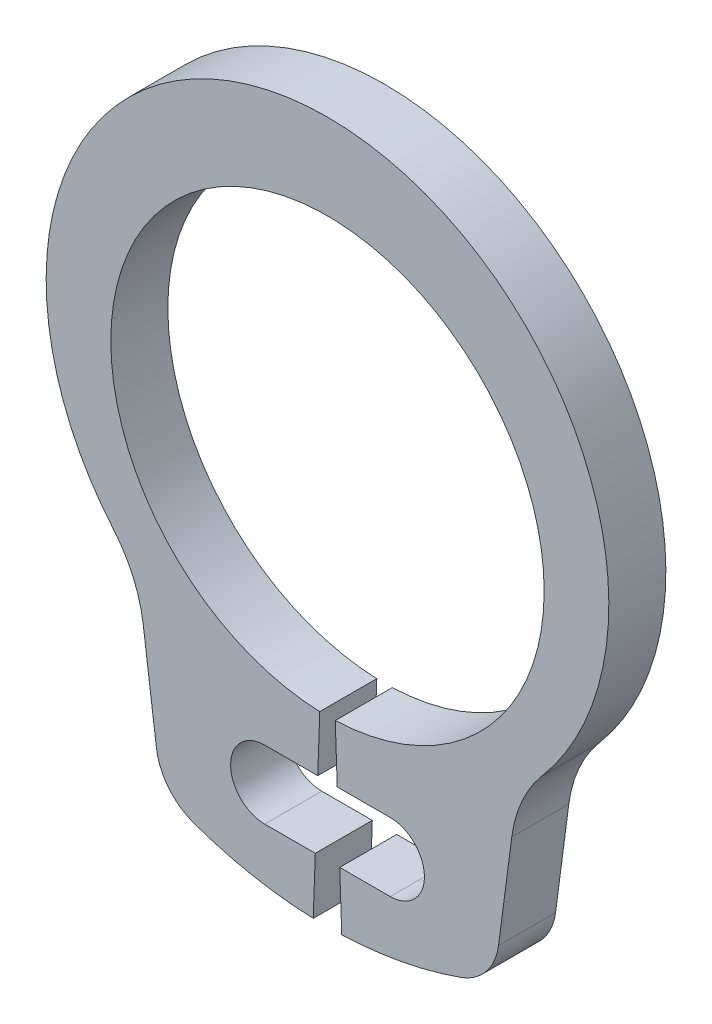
ISO-10303-21;
HEADER;
FILE_DESCRIPTION(('STEP AP214'),'2;1');
FILE_NAME('part.step','',(''),(''),'','','');
FILE_SCHEMA(('AUTOMOTIVE_DESIGN { 1 0 10303 214 1 1 1 1 }'));
ENDSEC;
DATA;
#1=APPLICATION_CONTEXT('core data for automotive mechanical design processes');
#2=APPLICATION_PROTOCOL_DEFINITION('international standard','automotive_design',2000,#1);
#3=PRODUCT_CONTEXT('',#1,'mechanical');
#4=PRODUCT('Part','Part','',(#3));
#5=PRODUCT_RELATED_PRODUCT_CATEGORY('part','',(#4));
#6=PRODUCT_DEFINITION_FORMATION('','',#4);
#7=PRODUCT_DEFINITION_CONTEXT('part definition',#1,'design');
#8=PRODUCT_DEFINITION('design','',#6,#7);
#9=PRODUCT_DEFINITION_SHAPE('','',#8);
#10=(LENGTH_UNIT() NAMED_UNIT(*) SI_UNIT(.MILLI.,.METRE.));
#11=(NAMED_UNIT(*) PLANE_ANGLE_UNIT() SI_UNIT($,.RADIAN.));
#12=(NAMED_UNIT(*) SI_UNIT($,.STERADIAN.) SOLID_ANGLE_UNIT());
#13=UNCERTAINTY_MEASURE_WITH_UNIT(LENGTH_MEASURE(1.E-05),#10,'distance_accuracy_value','');
#14=(GEOMETRIC_REPRESENTATION_CONTEXT(3) GLOBAL_UNCERTAINTY_ASSIGNED_CONTEXT((#13)) GLOBAL_UNIT_ASSIGNED_CONTEXT((#10,
#11,#12)) REPRESENTATION_CONTEXT('',''));
#15=CARTESIAN_POINT('',(0.,0.,0.));
#16=DIRECTION('',(0.,0.,1.));
#17=DIRECTION('',(1.,0.,0.));
#18=AXIS2_PLACEMENT_3D('',#15,#16,#17);
#19=CARTESIAN_POINT('',(-0.135714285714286,-3.79757575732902,-1.));
#20=DIRECTION('',(0.999362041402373,-0.0357142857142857,0.));
#21=DIRECTION('',(0.0357142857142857,0.999362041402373,0.));
#22=AXIS2_PLACEMENT_3D('',#19,#20,#21);
#23=PLANE('',#22);
#24=DIRECTION('',(0.,0.,1.));
#25=VECTOR('',#24,1.);
#26=CARTESIAN_POINT('',(-0.171140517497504,-4.78887743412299,-1.));
#27=LINE('',#26,#25);
#28=CARTESIAN_POINT('',(-0.171140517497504,-4.78887743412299,-1.));
#29=VERTEX_POINT('',#28);
#30=CARTESIAN_POINT('',(-0.171140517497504,-4.78887743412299,0.));
#31=VERTEX_POINT('',#30);
#32=EDGE_CURVE('E201',#29,#31,#27,.T.);
#33=ORIENTED_EDGE('',*,*,#32,.F.);
#34=DIRECTION('',(0.0357142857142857,0.999362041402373,0.));
#35=VECTOR('',#34,1.);
#36=CARTESIAN_POINT('',(-0.135714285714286,-3.79757575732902,-1.));
#37=LINE('',#36,#35);
#38=CARTESIAN_POINT('',(-0.135714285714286,-3.79757575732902,-1.));
#39=VERTEX_POINT('',#38);
#40=EDGE_CURVE('E283',#29,#39,#37,.T.);
#41=ORIENTED_EDGE('',*,*,#40,.T.);
#42=DIRECTION('',(0.,0.,1.));
#43=VECTOR('',#42,1.);
#44=CARTESIAN_POINT('',(-0.135714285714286,-3.79757575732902,-1.));
#45=LINE('',#44,#43);
#46=CARTESIAN_POINT('',(-0.135714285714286,-3.79757575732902,0.));
#47=VERTEX_POINT('',#46);
#48=EDGE_CURVE('E11',#39,#47,#45,.T.);
#49=ORIENTED_EDGE('',*,*,#48,.T.);
#50=DIRECTION('',(0.0357142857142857,0.999362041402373,0.));
#51=VECTOR('',#50,1.);
#52=CARTESIAN_POINT('',(-0.135714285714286,-3.79757575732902,0.));
#53=LINE('',#52,#51);
#54=EDGE_CURVE('E247',#31,#47,#53,.T.);
#55=ORIENTED_EDGE('',*,*,#54,.F.);
#56=EDGE_LOOP('',(#33,#41,#49,#55));
#57=FACE_BOUND('',#56,.T.);
#58=ADVANCED_FACE('F34',(#57),#23,.T.);
#59=CARTESIAN_POINT('',(0.135714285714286,-3.79757575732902,-1.));
#60=DIRECTION('',(-0.999362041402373,-0.0357142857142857,0.));
#61=DIRECTION('',(0.0357142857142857,-0.999362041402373,0.));
#62=AXIS2_PLACEMENT_3D('',#59,#60,#61);
#63=PLANE('',#62);
#64=DIRECTION('',(0.,0.,-1.));
#65=VECTOR('',#64,1.);
#66=CARTESIAN_POINT('',(0.171140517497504,-4.78887743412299,-1.));
#67=LINE('',#66,#65);
#68=CARTESIAN_POINT('',(0.171140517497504,-4.78887743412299,0.));
#69=VERTEX_POINT('',#68);
#70=CARTESIAN_POINT('',(0.171140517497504,-4.78887743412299,-1.));
#71=VERTEX_POINT('',#70);
#72=EDGE_CURVE('E205',#69,#71,#67,.T.);
#73=ORIENTED_EDGE('',*,*,#72,.F.);
#74=DIRECTION('',(0.0357142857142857,-0.999362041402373,0.));
#75=VECTOR('',#74,1.);
#76=CARTESIAN_POINT('',(0.135714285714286,-3.79757575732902,0.));
#77=LINE('',#76,#75);
#78=CARTESIAN_POINT('',(0.135714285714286,-3.79757575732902,0.));
#79=VERTEX_POINT('',#78);
#80=EDGE_CURVE('E218',#79,#69,#77,.T.);
#81=ORIENTED_EDGE('',*,*,#80,.F.);
#82=DIRECTION('',(0.,0.,1.));
#83=VECTOR('',#82,1.);
#84=CARTESIAN_POINT('',(0.135714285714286,-3.79757575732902,-1.));
#85=LINE('',#84,#83);
#86=CARTESIAN_POINT('',(0.135714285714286,-3.79757575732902,-1.));
#87=VERTEX_POINT('',#86);
#88=EDGE_CURVE('E38',#87,#79,#85,.T.);
#89=ORIENTED_EDGE('',*,*,#88,.F.);
#90=DIRECTION('',(0.0357142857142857,-0.999362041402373,0.));
#91=VECTOR('',#90,1.);
#92=CARTESIAN_POINT('',(0.135714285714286,-3.79757575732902,-1.));
#93=LINE('',#92,#91);
#94=EDGE_CURVE('E253',#87,#71,#93,.T.);
#95=ORIENTED_EDGE('',*,*,#94,.T.);
#96=EDGE_LOOP('',(#73,#81,#89,#95));
#97=FACE_BOUND('',#96,.T.);
#98=ADVANCED_FACE('F317',(#97),#63,.T.);
#99=CARTESIAN_POINT('',(0.,0.,-1.));
#100=DIRECTION('',(0.,0.,1.));
#101=DIRECTION('',(1.,0.,0.));
#102=AXIS2_PLACEMENT_3D('',#99,#100,#101);
#103=CYLINDRICAL_SURFACE('',#102,3.8);
#104=CARTESIAN_POINT('',(0.,0.,0.));
#105=DIRECTION('',(0.,0.,-1.));
#106=DIRECTION('',(1.,0.,0.));
#107=AXIS2_PLACEMENT_3D('',#104,#105,#106);
#108=CIRCLE('',#107,3.8);
#109=EDGE_CURVE('E214',#47,#79,#108,.T.);
#110=ORIENTED_EDGE('',*,*,#109,.F.);
#111=ORIENTED_EDGE('',*,*,#48,.F.);
#112=CARTESIAN_POINT('',(0.,0.,-1.));
#113=DIRECTION('',(0.,0.,-1.));
#114=DIRECTION('',(1.,0.,0.));
#115=AXIS2_PLACEMENT_3D('',#112,#113,#114);
#116=CIRCLE('',#115,3.8);
#117=EDGE_CURVE('E249',#39,#87,#116,.T.);
#118=ORIENTED_EDGE('',*,*,#117,.T.);
#119=ORIENTED_EDGE('',*,*,#88,.T.);
#120=EDGE_LOOP('',(#110,#111,#118,#119));
#121=FACE_BOUND('',#120,.T.);
#122=ADVANCED_FACE('F36',(#121),#103,.F.);
#123=DIRECTION('',(0.,0.,-1.));
#124=VECTOR('',#123,1.);
#125=CARTESIAN_POINT('',(-0.214025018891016,-5.98887743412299,-1.));
#126=LINE('',#125,#124);
#127=CARTESIAN_POINT('',(-0.214025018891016,-5.98887743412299,0.));
#128=VERTEX_POINT('',#127);
#129=CARTESIAN_POINT('',(-0.214025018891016,-5.98887743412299,-1.));
#130=VERTEX_POINT('',#129);
#131=EDGE_CURVE('E339',#128,#130,#126,.T.);
#132=ORIENTED_EDGE('',*,*,#131,.F.);
#133=CARTESIAN_POINT('',(-0.25,-6.99553428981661,0.));
#134=VERTEX_POINT('',#133);
#135=EDGE_CURVE('E195',#134,#128,#53,.T.);
#136=ORIENTED_EDGE('',*,*,#135,.F.);
#137=DIRECTION('',(0.,0.,1.));
#138=VECTOR('',#137,1.);
#139=CARTESIAN_POINT('',(-0.25,-6.99553428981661,-1.));
#140=LINE('',#139,#138);
#141=CARTESIAN_POINT('',(-0.25,-6.99553428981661,-1.));
#142=VERTEX_POINT('',#141);
#143=EDGE_CURVE('E43',#142,#134,#140,.T.);
#144=ORIENTED_EDGE('',*,*,#143,.F.);
#145=EDGE_CURVE('E284',#142,#130,#37,.T.);
#146=ORIENTED_EDGE('',*,*,#145,.T.);
#147=EDGE_LOOP('',(#132,#136,#144,#146));
#148=FACE_BOUND('',#147,.T.);
#149=ADVANCED_FACE('F348',(#148),#23,.T.);
#150=CARTESIAN_POINT('',(0.,0.,-1.));
#151=DIRECTION('',(0.,0.,1.));
#152=DIRECTION('',(1.,0.,0.));
#153=AXIS2_PLACEMENT_3D('',#150,#151,#152);
#154=CYLINDRICAL_SURFACE('',#153,7.);
#155=CARTESIAN_POINT('',(0.,0.,0.));
#156=DIRECTION('',(0.,0.,1.));
#157=DIRECTION('',(1.,0.,0.));
#158=AXIS2_PLACEMENT_3D('',#155,#156,#157);
#159=CIRCLE('',#158,7.);
#160=CARTESIAN_POINT('',(-2.34274629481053,-6.59632775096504,0.));
#161=VERTEX_POINT('',#160);
#162=EDGE_CURVE('E245',#161,#134,#159,.T.);
#163=ORIENTED_EDGE('',*,*,#162,.F.);
#164=DIRECTION('',(0.,0.,1.));
#165=VECTOR('',#164,1.);
#166=CARTESIAN_POINT('',(-2.34274629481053,-6.59632775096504,-1.));
#167=LINE('',#166,#165);
#168=CARTESIAN_POINT('',(-2.34274629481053,-6.59632775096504,-1.));
#169=VERTEX_POINT('',#168);
#170=EDGE_CURVE('E288',#169,#161,#167,.T.);
#171=ORIENTED_EDGE('',*,*,#170,.F.);
#172=CARTESIAN_POINT('',(0.,0.,-1.));
#173=DIRECTION('',(0.,0.,1.));
#174=DIRECTION('',(1.,0.,0.));
#175=AXIS2_PLACEMENT_3D('',#172,#173,#174);
#176=CIRCLE('',#175,7.);
#177=EDGE_CURVE('E280',#169,#142,#176,.T.);
#178=ORIENTED_EDGE('',*,*,#177,.T.);
#179=ORIENTED_EDGE('',*,*,#143,.T.);
#180=EDGE_LOOP('',(#163,#171,#178,#179));
#181=FACE_BOUND('',#180,.T.);
#182=ADVANCED_FACE('F351',(#181),#154,.T.);
#183=CARTESIAN_POINT('',(-2.00806825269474,-5.65399521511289,-1.));
#184=DIRECTION('',(0.,0.,1.));
#185=DIRECTION('',(1.,0.,0.));
#186=AXIS2_PLACEMENT_3D('',#183,#184,#185);
#187=CYLINDRICAL_SURFACE('',#186,1.);
#188=CARTESIAN_POINT('',(-2.00806825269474,-5.65399521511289,0.));
#189=DIRECTION('',(0.,0.,1.));
#190=DIRECTION('',(1.,0.,0.));
#191=AXIS2_PLACEMENT_3D('',#188,#189,#190);
#192=CIRCLE('',#191,1.);
#193=CARTESIAN_POINT('',(-2.99951311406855,-5.78452140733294,0.));
#194=VERTEX_POINT('',#193);
#195=EDGE_CURVE('E242',#194,#161,#192,.T.);
#196=ORIENTED_EDGE('',*,*,#195,.F.);
#197=DIRECTION('',(0.,0.,1.));
#198=VECTOR('',#197,1.);
#199=CARTESIAN_POINT('',(-2.99951311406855,-5.78452140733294,-1.));
#200=LINE('',#199,#198);
#201=CARTESIAN_POINT('',(-2.99951311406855,-5.78452140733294,-1.));
#202=VERTEX_POINT('',#201);
#203=EDGE_CURVE('E290',#202,#194,#200,.T.);
#204=ORIENTED_EDGE('',*,*,#203,.F.);
#205=CARTESIAN_POINT('',(-2.00806825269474,-5.65399521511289,-1.));
#206=DIRECTION('',(0.,0.,1.));
#207=DIRECTION('',(1.,0.,0.));
#208=AXIS2_PLACEMENT_3D('',#205,#206,#207);
#209=CIRCLE('',#208,1.);
#210=EDGE_CURVE('E277',#202,#169,#209,.T.);
#211=ORIENTED_EDGE('',*,*,#210,.T.);
#212=ORIENTED_EDGE('',*,*,#170,.T.);
#213=EDGE_LOOP('',(#196,#204,#211,#212));
#214=FACE_BOUND('',#213,.T.);
#215=ADVANCED_FACE('F356',(#214),#187,.T.);
#216=CARTESIAN_POINT('',(-3.232103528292,-4.01782181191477,-1.));
#217=DIRECTION('',(-0.99144486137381,-0.130526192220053,0.));
#218=DIRECTION('',(0.130526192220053,-0.99144486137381,0.));
#219=AXIS2_PLACEMENT_3D('',#216,#217,#218);
#220=PLANE('',#219);
#221=DIRECTION('',(0.130526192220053,-0.99144486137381,0.));
#222=VECTOR('',#221,1.);
#223=CARTESIAN_POINT('',(-3.232103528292,-4.01782181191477,0.));
#224=LINE('',#223,#222);
#225=CARTESIAN_POINT('',(-3.232103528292,-4.01782181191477,0.));
#226=VERTEX_POINT('',#225);
#227=EDGE_CURVE('E239',#226,#194,#224,.T.);
#228=ORIENTED_EDGE('',*,*,#227,.F.);
#229=DIRECTION('',(0.,0.,1.));
#230=VECTOR('',#229,1.);
#231=CARTESIAN_POINT('',(-3.232103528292,-4.01782181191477,-1.));
#232=LINE('',#231,#230);
#233=CARTESIAN_POINT('',(-3.232103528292,-4.01782181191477,-1.));
#234=VERTEX_POINT('',#233);
#235=EDGE_CURVE('E292',#234,#226,#232,.T.);
#236=ORIENTED_EDGE('',*,*,#235,.F.);
#237=DIRECTION('',(0.130526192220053,-0.99144486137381,0.));
#238=VECTOR('',#237,1.);
#239=CARTESIAN_POINT('',(-3.232103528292,-4.01782181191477,-1.));
#240=LINE('',#239,#238);
#241=EDGE_CURVE('E274',#234,#202,#240,.T.);
#242=ORIENTED_EDGE('',*,*,#241,.T.);
#243=ORIENTED_EDGE('',*,*,#203,.T.);
#244=EDGE_LOOP('',(#228,#236,#242,#243));
#245=FACE_BOUND('',#244,.T.);
#246=ADVANCED_FACE('F359',(#245),#220,.T.);
#247=CARTESIAN_POINT('',(-5.50977445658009,-4.3176828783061,-1.));
#248=DIRECTION('',(0.,0.,1.));
#249=DIRECTION('',(1.,0.,0.));
#250=AXIS2_PLACEMENT_3D('',#247,#248,#249);
#251=CYLINDRICAL_SURFACE('',#250,2.29732486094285);
#252=CARTESIAN_POINT('',(-5.50977445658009,-4.3176828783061,0.));
#253=DIRECTION('',(0.,0.,-1.));
#254=DIRECTION('',(1.,0.,0.));
#255=AXIS2_PLACEMENT_3D('',#252,#253,#254);
#256=CIRCLE('',#255,2.29732486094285);
#257=CARTESIAN_POINT('',(-3.75939498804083,-2.82977386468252,0.));
#258=VERTEX_POINT('',#257);
#259=EDGE_CURVE('E236',#258,#226,#256,.T.);
#260=ORIENTED_EDGE('',*,*,#259,.F.);
#261=DIRECTION('',(0.,0.,1.));
#262=VECTOR('',#261,1.);
#263=CARTESIAN_POINT('',(-3.75939498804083,-2.82977386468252,-1.));
#264=LINE('',#263,#262);
#265=CARTESIAN_POINT('',(-3.75939498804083,-2.82977386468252,-1.));
#266=VERTEX_POINT('',#265);
#267=EDGE_CURVE('E294',#266,#258,#264,.T.);
#268=ORIENTED_EDGE('',*,*,#267,.F.);
#269=CARTESIAN_POINT('',(-5.50977445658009,-4.3176828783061,-1.));
#270=DIRECTION('',(0.,0.,-1.));
#271=DIRECTION('',(1.,0.,0.));
#272=AXIS2_PLACEMENT_3D('',#269,#270,#271);
#273=CIRCLE('',#272,2.29732486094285);
#274=EDGE_CURVE('E271',#266,#234,#273,.T.);
#275=ORIENTED_EDGE('',*,*,#274,.T.);
#276=ORIENTED_EDGE('',*,*,#235,.T.);
#277=EDGE_LOOP('',(#260,#268,#275,#276));
#278=FACE_BOUND('',#277,.T.);
#279=ADVANCED_FACE('F364',(#278),#251,.F.);
#280=CARTESIAN_POINT('',(0.,0.365897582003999,-1.));
#281=DIRECTION('',(0.,0.,1.));
#282=DIRECTION('',(1.,0.,0.));
#283=AXIS2_PLACEMENT_3D('',#280,#281,#282);
#284=CYLINDRICAL_SURFACE('',#283,4.934102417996);
#285=CARTESIAN_POINT('',(0.,0.365897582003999,0.));
#286=DIRECTION('',(0.,0.,1.));
#287=DIRECTION('',(1.,0.,0.));
#288=AXIS2_PLACEMENT_3D('',#285,#286,#287);
#289=CIRCLE('',#288,4.934102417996);
#290=CARTESIAN_POINT('',(3.75939498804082,-2.82977386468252,0.));
#291=VERTEX_POINT('',#290);
#292=EDGE_CURVE('E233',#291,#258,#289,.T.);
#293=ORIENTED_EDGE('',*,*,#292,.F.);
#294=DIRECTION('',(0.,0.,1.));
#295=VECTOR('',#294,1.);
#296=CARTESIAN_POINT('',(3.75939498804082,-2.82977386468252,-1.));
#297=LINE('',#296,#295);
#298=CARTESIAN_POINT('',(3.75939498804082,-2.82977386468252,-1.));
#299=VERTEX_POINT('',#298);
#300=EDGE_CURVE('E296',#299,#291,#297,.T.);
#301=ORIENTED_EDGE('',*,*,#300,.F.);
#302=CARTESIAN_POINT('',(0.,0.365897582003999,-1.));
#303=DIRECTION('',(0.,0.,1.));
#304=DIRECTION('',(1.,0.,0.));
#305=AXIS2_PLACEMENT_3D('',#302,#303,#304);
#306=CIRCLE('',#305,4.934102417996);
#307=EDGE_CURVE('E268',#299,#266,#306,.T.);
#308=ORIENTED_EDGE('',*,*,#307,.T.);
#309=ORIENTED_EDGE('',*,*,#267,.T.);
#310=EDGE_LOOP('',(#293,#301,#308,#309));
#311=FACE_BOUND('',#310,.T.);
#312=ADVANCED_FACE('F367',(#311),#284,.T.);
#313=CARTESIAN_POINT('',(5.50977445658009,-4.3176828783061,-1.));
#314=DIRECTION('',(0.,0.,1.));
#315=DIRECTION('',(1.,0.,0.));
#316=AXIS2_PLACEMENT_3D('',#313,#314,#315);
#317=CYLINDRICAL_SURFACE('',#316,2.29732486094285);
#318=CARTESIAN_POINT('',(5.50977445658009,-4.3176828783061,0.));
#319=DIRECTION('',(0.,0.,-1.));
#320=DIRECTION('',(1.,0.,0.));
#321=AXIS2_PLACEMENT_3D('',#318,#319,#320);
#322=CIRCLE('',#321,2.29732486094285);
#323=CARTESIAN_POINT('',(3.232103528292,-4.01782181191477,0.));
#324=VERTEX_POINT('',#323);
#325=EDGE_CURVE('E230',#324,#291,#322,.T.);
#326=ORIENTED_EDGE('',*,*,#325,.F.);
#327=DIRECTION('',(0.,0.,1.));
#328=VECTOR('',#327,1.);
#329=CARTESIAN_POINT('',(3.232103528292,-4.01782181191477,-1.));
#330=LINE('',#329,#328);
#331=CARTESIAN_POINT('',(3.232103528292,-4.01782181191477,-1.));
#332=VERTEX_POINT('',#331);
#333=EDGE_CURVE('E298',#332,#324,#330,.T.);
#334=ORIENTED_EDGE('',*,*,#333,.F.);
#335=CARTESIAN_POINT('',(5.50977445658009,-4.3176828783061,-1.));
#336=DIRECTION('',(0.,0.,-1.));
#337=DIRECTION('',(1.,0.,0.));
#338=AXIS2_PLACEMENT_3D('',#335,#336,#337);
#339=CIRCLE('',#338,2.29732486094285);
#340=EDGE_CURVE('E265',#332,#299,#339,.T.);
#341=ORIENTED_EDGE('',*,*,#340,.T.);
#342=ORIENTED_EDGE('',*,*,#300,.T.);
#343=EDGE_LOOP('',(#326,#334,#341,#342));
#344=FACE_BOUND('',#343,.T.);
#345=ADVANCED_FACE('F372',(#344),#317,.F.);
#346=CARTESIAN_POINT('',(3.232103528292,-4.01782181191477,-1.));
#347=DIRECTION('',(0.99144486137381,-0.130526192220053,0.));
#348=DIRECTION('',(0.130526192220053,0.99144486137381,0.));
#349=AXIS2_PLACEMENT_3D('',#346,#347,#348);
#350=PLANE('',#349);
#351=DIRECTION('',(0.130526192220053,0.99144486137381,0.));
#352=VECTOR('',#351,1.);
#353=CARTESIAN_POINT('',(3.232103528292,-4.01782181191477,0.));
#354=LINE('',#353,#352);
#355=CARTESIAN_POINT('',(2.99951311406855,-5.78452140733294,0.));
#356=VERTEX_POINT('',#355);
#357=EDGE_CURVE('E227',#356,#324,#354,.T.);
#358=ORIENTED_EDGE('',*,*,#357,.F.);
#359=DIRECTION('',(0.,0.,1.));
#360=VECTOR('',#359,1.);
#361=CARTESIAN_POINT('',(2.99951311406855,-5.78452140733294,-1.));
#362=LINE('',#361,#360);
#363=CARTESIAN_POINT('',(2.99951311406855,-5.78452140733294,-1.));
#364=VERTEX_POINT('',#363);
#365=EDGE_CURVE('E300',#364,#356,#362,.T.);
#366=ORIENTED_EDGE('',*,*,#365,.F.);
#367=DIRECTION('',(0.130526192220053,0.99144486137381,0.));
#368=VECTOR('',#367,1.);
#369=CARTESIAN_POINT('',(3.232103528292,-4.01782181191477,-1.));
#370=LINE('',#369,#368);
#371=EDGE_CURVE('E262',#364,#332,#370,.T.);
#372=ORIENTED_EDGE('',*,*,#371,.T.);
#373=ORIENTED_EDGE('',*,*,#333,.T.);
#374=EDGE_LOOP('',(#358,#366,#372,#373));
#375=FACE_BOUND('',#374,.T.);
#376=ADVANCED_FACE('F375',(#375),#350,.T.);
#377=CARTESIAN_POINT('',(2.00806825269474,-5.65399521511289,-1.));
#378=DIRECTION('',(0.,0.,1.));
#379=DIRECTION('',(1.,0.,0.));
#380=AXIS2_PLACEMENT_3D('',#377,#378,#379);
#381=CYLINDRICAL_SURFACE('',#380,1.);
#382=CARTESIAN_POINT('',(2.00806825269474,-5.65399521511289,0.));
#383=DIRECTION('',(0.,0.,1.));
#384=DIRECTION('',(-1.,0.,0.));
#385=AXIS2_PLACEMENT_3D('',#382,#383,#384);
#386=CIRCLE('',#385,1.);
#387=CARTESIAN_POINT('',(2.34274629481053,-6.59632775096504,0.));
#388=VERTEX_POINT('',#387);
#389=EDGE_CURVE('E224',#388,#356,#386,.T.);
#390=ORIENTED_EDGE('',*,*,#389,.F.);
#391=DIRECTION('',(0.,0.,1.));
#392=VECTOR('',#391,1.);
#393=CARTESIAN_POINT('',(2.34274629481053,-6.59632775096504,-1.));
#394=LINE('',#393,#392);
#395=CARTESIAN_POINT('',(2.34274629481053,-6.59632775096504,-1.));
#396=VERTEX_POINT('',#395);
#397=EDGE_CURVE('E302',#396,#388,#394,.T.);
#398=ORIENTED_EDGE('',*,*,#397,.F.);
#399=CARTESIAN_POINT('',(2.00806825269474,-5.65399521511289,-1.));
#400=DIRECTION('',(0.,0.,1.));
#401=DIRECTION('',(-1.,0.,0.));
#402=AXIS2_PLACEMENT_3D('',#399,#400,#401);
#403=CIRCLE('',#402,1.);
#404=EDGE_CURVE('E259',#396,#364,#403,.T.);
#405=ORIENTED_EDGE('',*,*,#404,.T.);
#406=ORIENTED_EDGE('',*,*,#365,.T.);
#407=EDGE_LOOP('',(#390,#398,#405,#406));
#408=FACE_BOUND('',#407,.T.);
#409=ADVANCED_FACE('F380',(#408),#381,.T.);
#410=CARTESIAN_POINT('',(0.,0.,-1.));
#411=DIRECTION('',(0.,0.,1.));
#412=DIRECTION('',(1.,0.,0.));
#413=AXIS2_PLACEMENT_3D('',#410,#411,#412);
#414=CYLINDRICAL_SURFACE('',#413,7.);
#415=CARTESIAN_POINT('',(0.,0.,0.));
#416=DIRECTION('',(0.,0.,1.));
#417=DIRECTION('',(1.,0.,0.));
#418=AXIS2_PLACEMENT_3D('',#415,#416,#417);
#419=CIRCLE('',#418,7.);
#420=CARTESIAN_POINT('',(0.249999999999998,-6.99553428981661,0.));
#421=VERTEX_POINT('',#420);
#422=EDGE_CURVE('E221',#421,#388,#419,.T.);
#423=ORIENTED_EDGE('',*,*,#422,.F.);
#424=DIRECTION('',(0.,0.,1.));
#425=VECTOR('',#424,1.);
#426=CARTESIAN_POINT('',(0.249999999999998,-6.99553428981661,-1.));
#427=LINE('',#426,#425);
#428=CARTESIAN_POINT('',(0.249999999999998,-6.99553428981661,-1.));
#429=VERTEX_POINT('',#428);
#430=EDGE_CURVE('E303',#429,#421,#427,.T.);
#431=ORIENTED_EDGE('',*,*,#430,.F.);
#432=CARTESIAN_POINT('',(0.,0.,-1.));
#433=DIRECTION('',(0.,0.,1.));
#434=DIRECTION('',(1.,0.,0.));
#435=AXIS2_PLACEMENT_3D('',#432,#433,#434);
#436=CIRCLE('',#435,7.);
#437=EDGE_CURVE('E256',#429,#396,#436,.T.);
#438=ORIENTED_EDGE('',*,*,#437,.T.);
#439=ORIENTED_EDGE('',*,*,#397,.T.);
#440=EDGE_LOOP('',(#423,#431,#438,#439));
#441=FACE_BOUND('',#440,.T.);
#442=ADVANCED_FACE('F382',(#441),#414,.T.);
#443=DIRECTION('',(0.,0.,1.));
#444=VECTOR('',#443,1.);
#445=CARTESIAN_POINT('',(0.214025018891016,-5.98887743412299,-1.));
#446=LINE('',#445,#444);
#447=CARTESIAN_POINT('',(0.214025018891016,-5.98887743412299,-1.));
#448=VERTEX_POINT('',#447);
#449=CARTESIAN_POINT('',(0.214025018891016,-5.98887743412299,0.));
#450=VERTEX_POINT('',#449);
#451=EDGE_CURVE('E335',#448,#450,#446,.T.);
#452=ORIENTED_EDGE('',*,*,#451,.F.);
#453=EDGE_CURVE('E252',#448,#429,#93,.T.);
#454=ORIENTED_EDGE('',*,*,#453,.T.);
#455=ORIENTED_EDGE('',*,*,#430,.T.);
#456=EDGE_CURVE('E217',#450,#421,#77,.T.);
#457=ORIENTED_EDGE('',*,*,#456,.F.);
#458=EDGE_LOOP('',(#452,#454,#455,#457));
#459=FACE_BOUND('',#458,.T.);
#460=ADVANCED_FACE('F385',(#459),#63,.T.);
#461=CARTESIAN_POINT('',(0.,0.,-1.));
#462=DIRECTION('',(0.,0.,1.));
#463=DIRECTION('',(1.,0.,0.));
#464=AXIS2_PLACEMENT_3D('',#461,#462,#463);
#465=PLANE('',#464);
#466=CARTESIAN_POINT('',(1.1,-5.38887743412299,-1.));
#467=DIRECTION('',(0.,0.,1.));
#468=DIRECTION('',(1.,0.,0.));
#469=AXIS2_PLACEMENT_3D('',#466,#467,#468);
#470=CIRCLE('',#469,0.6);
#471=CARTESIAN_POINT('',(1.1,-5.98887743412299,-1.));
#472=VERTEX_POINT('',#471);
#473=CARTESIAN_POINT('',(1.1,-4.78887743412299,-1.));
#474=VERTEX_POINT('',#473);
#475=EDGE_CURVE('E211',#472,#474,#470,.T.);
#476=ORIENTED_EDGE('',*,*,#475,.T.);
#477=DIRECTION('',(-1.,0.,0.));
#478=VECTOR('',#477,1.);
#479=CARTESIAN_POINT('',(-1.1,-4.78887743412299,-1.));
#480=LINE('',#479,#478);
#481=EDGE_CURVE('E59',#474,#71,#480,.T.);
#482=ORIENTED_EDGE('',*,*,#481,.T.);
#483=ORIENTED_EDGE('',*,*,#94,.F.);
#484=ORIENTED_EDGE('',*,*,#117,.F.);
#485=ORIENTED_EDGE('',*,*,#40,.F.);
#486=CARTESIAN_POINT('',(-1.1,-4.78887743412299,-1.));
#487=VERTEX_POINT('',#486);
#488=EDGE_CURVE('E196',#29,#487,#480,.T.);
#489=ORIENTED_EDGE('',*,*,#488,.T.);
#490=CARTESIAN_POINT('',(-1.1,-5.38887743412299,-1.));
#491=DIRECTION('',(0.,0.,1.));
#492=DIRECTION('',(1.,0.,0.));
#493=AXIS2_PLACEMENT_3D('',#490,#491,#492);
#494=CIRCLE('',#493,0.6);
#495=CARTESIAN_POINT('',(-1.1,-5.98887743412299,-1.));
#496=VERTEX_POINT('',#495);
#497=EDGE_CURVE('E200',#487,#496,#494,.T.);
#498=ORIENTED_EDGE('',*,*,#497,.T.);
#499=DIRECTION('',(1.,0.,0.));
#500=VECTOR('',#499,1.);
#501=CARTESIAN_POINT('',(1.1,-5.98887743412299,-1.));
#502=LINE('',#501,#500);
#503=EDGE_CURVE('E178',#496,#130,#502,.T.);
#504=ORIENTED_EDGE('',*,*,#503,.T.);
#505=ORIENTED_EDGE('',*,*,#145,.F.);
#506=ORIENTED_EDGE('',*,*,#177,.F.);
#507=ORIENTED_EDGE('',*,*,#210,.F.);
#508=ORIENTED_EDGE('',*,*,#241,.F.);
#509=ORIENTED_EDGE('',*,*,#274,.F.);
#510=ORIENTED_EDGE('',*,*,#307,.F.);
#511=ORIENTED_EDGE('',*,*,#340,.F.);
#512=ORIENTED_EDGE('',*,*,#371,.F.);
#513=ORIENTED_EDGE('',*,*,#404,.F.);
#514=ORIENTED_EDGE('',*,*,#437,.F.);
#515=ORIENTED_EDGE('',*,*,#453,.F.);
#516=EDGE_CURVE('E328',#448,#472,#502,.T.);
#517=ORIENTED_EDGE('',*,*,#516,.T.);
#518=EDGE_LOOP('',(#476,#482,#483,#484,#485,#489,#498,#504,#505,#506,#507,#508,#509,#510,#511,
#512,#513,#514,#515,#517));
#519=FACE_BOUND('',#518,.T.);
#520=ADVANCED_FACE('F324',(#519),#465,.F.);
#521=CARTESIAN_POINT('',(0.,0.,0.));
#522=DIRECTION('',(0.,0.,1.));
#523=DIRECTION('',(1.,0.,0.));
#524=AXIS2_PLACEMENT_3D('',#521,#522,#523);
#525=PLANE('',#524);
#526=DIRECTION('',(-1.,0.,0.));
#527=VECTOR('',#526,1.);
#528=CARTESIAN_POINT('',(-1.1,-4.78887743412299,0.));
#529=LINE('',#528,#527);
#530=CARTESIAN_POINT('',(1.1,-4.78887743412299,0.));
#531=VERTEX_POINT('',#530);
#532=EDGE_CURVE('E341',#531,#69,#529,.T.);
#533=ORIENTED_EDGE('',*,*,#532,.F.);
#534=CARTESIAN_POINT('',(1.1,-5.38887743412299,0.));
#535=DIRECTION('',(0.,0.,1.));
#536=DIRECTION('',(1.,0.,0.));
#537=AXIS2_PLACEMENT_3D('',#534,#535,#536);
#538=CIRCLE('',#537,0.6);
#539=CARTESIAN_POINT('',(1.1,-5.98887743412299,0.));
#540=VERTEX_POINT('',#539);
#541=EDGE_CURVE('E203',#540,#531,#538,.T.);
#542=ORIENTED_EDGE('',*,*,#541,.F.);
#543=DIRECTION('',(1.,0.,0.));
#544=VECTOR('',#543,1.);
#545=CARTESIAN_POINT('',(1.1,-5.98887743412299,0.));
#546=LINE('',#545,#544);
#547=EDGE_CURVE('E51',#450,#540,#546,.T.);
#548=ORIENTED_EDGE('',*,*,#547,.F.);
#549=ORIENTED_EDGE('',*,*,#456,.T.);
#550=ORIENTED_EDGE('',*,*,#422,.T.);
#551=ORIENTED_EDGE('',*,*,#389,.T.);
#552=ORIENTED_EDGE('',*,*,#357,.T.);
#553=ORIENTED_EDGE('',*,*,#325,.T.);
#554=ORIENTED_EDGE('',*,*,#292,.T.);
#555=ORIENTED_EDGE('',*,*,#259,.T.);
#556=ORIENTED_EDGE('',*,*,#227,.T.);
#557=ORIENTED_EDGE('',*,*,#195,.T.);
#558=ORIENTED_EDGE('',*,*,#162,.T.);
#559=ORIENTED_EDGE('',*,*,#135,.T.);
#560=CARTESIAN_POINT('',(-1.1,-5.98887743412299,0.));
#561=VERTEX_POINT('',#560);
#562=EDGE_CURVE('E175',#561,#128,#546,.T.);
#563=ORIENTED_EDGE('',*,*,#562,.F.);
#564=CARTESIAN_POINT('',(-1.1,-5.38887743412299,0.));
#565=DIRECTION('',(0.,0.,1.));
#566=DIRECTION('',(1.,0.,0.));
#567=AXIS2_PLACEMENT_3D('',#564,#565,#566);
#568=CIRCLE('',#567,0.6);
#569=CARTESIAN_POINT('',(-1.1,-4.78887743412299,0.));
#570=VERTEX_POINT('',#569);
#571=EDGE_CURVE('E192',#570,#561,#568,.T.);
#572=ORIENTED_EDGE('',*,*,#571,.F.);
#573=EDGE_CURVE('E319',#31,#570,#529,.T.);
#574=ORIENTED_EDGE('',*,*,#573,.F.);
#575=ORIENTED_EDGE('',*,*,#54,.T.);
#576=ORIENTED_EDGE('',*,*,#109,.T.);
#577=ORIENTED_EDGE('',*,*,#80,.T.);
#578=EDGE_LOOP('',(#533,#542,#548,#549,#550,#551,#552,#553,#554,#555,#556,#557,#558,#559,#563,
#572,#574,#575,#576,#577));
#579=FACE_BOUND('',#578,.T.);
#580=ADVANCED_FACE('F190',(#579),#525,.T.);
#581=CARTESIAN_POINT('',(1.1,-5.38887743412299,-1.));
#582=DIRECTION('',(0.,0.,1.));
#583=DIRECTION('',(1.,0.,0.));
#584=AXIS2_PLACEMENT_3D('',#581,#582,#583);
#585=CYLINDRICAL_SURFACE('',#584,0.6);
#586=ORIENTED_EDGE('',*,*,#541,.T.);
#587=DIRECTION('',(0.,0.,1.));
#588=VECTOR('',#587,1.);
#589=CARTESIAN_POINT('',(1.1,-4.78887743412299,-1.));
#590=LINE('',#589,#588);
#591=EDGE_CURVE('E333',#474,#531,#590,.T.);
#592=ORIENTED_EDGE('',*,*,#591,.F.);
#593=ORIENTED_EDGE('',*,*,#475,.F.);
#594=DIRECTION('',(0.,0.,1.));
#595=VECTOR('',#594,1.);
#596=CARTESIAN_POINT('',(1.1,-5.98887743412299,-1.));
#597=LINE('',#596,#595);
#598=EDGE_CURVE('E183',#472,#540,#597,.T.);
#599=ORIENTED_EDGE('',*,*,#598,.T.);
#600=EDGE_LOOP('',(#586,#592,#593,#599));
#601=FACE_BOUND('',#600,.T.);
#602=ADVANCED_FACE('F388',(#601),#585,.F.);
#603=CARTESIAN_POINT('',(-1.1,-5.38887743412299,-1.));
#604=DIRECTION('',(0.,0.,1.));
#605=DIRECTION('',(1.,0.,0.));
#606=AXIS2_PLACEMENT_3D('',#603,#604,#605);
#607=CYLINDRICAL_SURFACE('',#606,0.6);
#608=ORIENTED_EDGE('',*,*,#571,.T.);
#609=DIRECTION('',(0.,0.,1.));
#610=VECTOR('',#609,1.);
#611=CARTESIAN_POINT('',(-1.1,-5.98887743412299,-1.));
#612=LINE('',#611,#610);
#613=EDGE_CURVE('E172',#496,#561,#612,.T.);
#614=ORIENTED_EDGE('',*,*,#613,.F.);
#615=ORIENTED_EDGE('',*,*,#497,.F.);
#616=DIRECTION('',(0.,0.,1.));
#617=VECTOR('',#616,1.);
#618=CARTESIAN_POINT('',(-1.1,-4.78887743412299,-1.));
#619=LINE('',#618,#617);
#620=EDGE_CURVE('E184',#487,#570,#619,.T.);
#621=ORIENTED_EDGE('',*,*,#620,.T.);
#622=EDGE_LOOP('',(#608,#614,#615,#621));
#623=FACE_BOUND('',#622,.T.);
#624=ADVANCED_FACE('F199',(#623),#607,.F.);
#625=CARTESIAN_POINT('',(-1.1,-4.78887743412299,-1.));
#626=DIRECTION('',(0.,1.,0.));
#627=DIRECTION('',(0.,0.,1.));
#628=AXIS2_PLACEMENT_3D('',#625,#626,#627);
#629=PLANE('',#628);
#630=ORIENTED_EDGE('',*,*,#32,.T.);
#631=ORIENTED_EDGE('',*,*,#573,.T.);
#632=ORIENTED_EDGE('',*,*,#620,.F.);
#633=ORIENTED_EDGE('',*,*,#488,.F.);
#634=EDGE_LOOP('',(#630,#631,#632,#633));
#635=FACE_BOUND('',#634,.T.);
#636=ADVANCED_FACE('F344',(#635),#629,.F.);
#637=CARTESIAN_POINT('',(1.1,-5.98887743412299,-1.));
#638=DIRECTION('',(0.,-1.,0.));
#639=DIRECTION('',(0.,0.,-1.));
#640=AXIS2_PLACEMENT_3D('',#637,#638,#639);
#641=PLANE('',#640);
#642=ORIENTED_EDGE('',*,*,#131,.T.);
#643=ORIENTED_EDGE('',*,*,#503,.F.);
#644=ORIENTED_EDGE('',*,*,#613,.T.);
#645=ORIENTED_EDGE('',*,*,#562,.T.);
#646=EDGE_LOOP('',(#642,#643,#644,#645));
#647=FACE_BOUND('',#646,.T.);
#648=ADVANCED_FACE('F174',(#647),#641,.F.);
#649=ORIENTED_EDGE('',*,*,#451,.T.);
#650=ORIENTED_EDGE('',*,*,#547,.T.);
#651=ORIENTED_EDGE('',*,*,#598,.F.);
#652=ORIENTED_EDGE('',*,*,#516,.F.);
#653=EDGE_LOOP('',(#649,#650,#651,#652));
#654=FACE_BOUND('',#653,.T.);
#655=ADVANCED_FACE('F386',(#654),#641,.F.);
#656=ORIENTED_EDGE('',*,*,#72,.T.);
#657=ORIENTED_EDGE('',*,*,#481,.F.);
#658=ORIENTED_EDGE('',*,*,#591,.T.);
#659=ORIENTED_EDGE('',*,*,#532,.T.);
#660=EDGE_LOOP('',(#656,#657,#658,#659));
#661=FACE_BOUND('',#660,.T.);
#662=ADVANCED_FACE('F340',(#661),#629,.F.);
#663=CLOSED_SHELL('',(#58,#98,#122,#149,#182,#215,#246,#279,#312,#345,#376,#409,#442,#460,#520,
#580,#602,#624,#636,#648,#655,#662));
#664=MANIFOLD_SOLID_BREP('B2',#663);
#665=ADVANCED_BREP_SHAPE_REPRESENTATION('',(#18,#664),#14);
#666=SHAPE_DEFINITION_REPRESENTATION(#9,#665);
ENDSEC;
END-ISO-10303-21;
